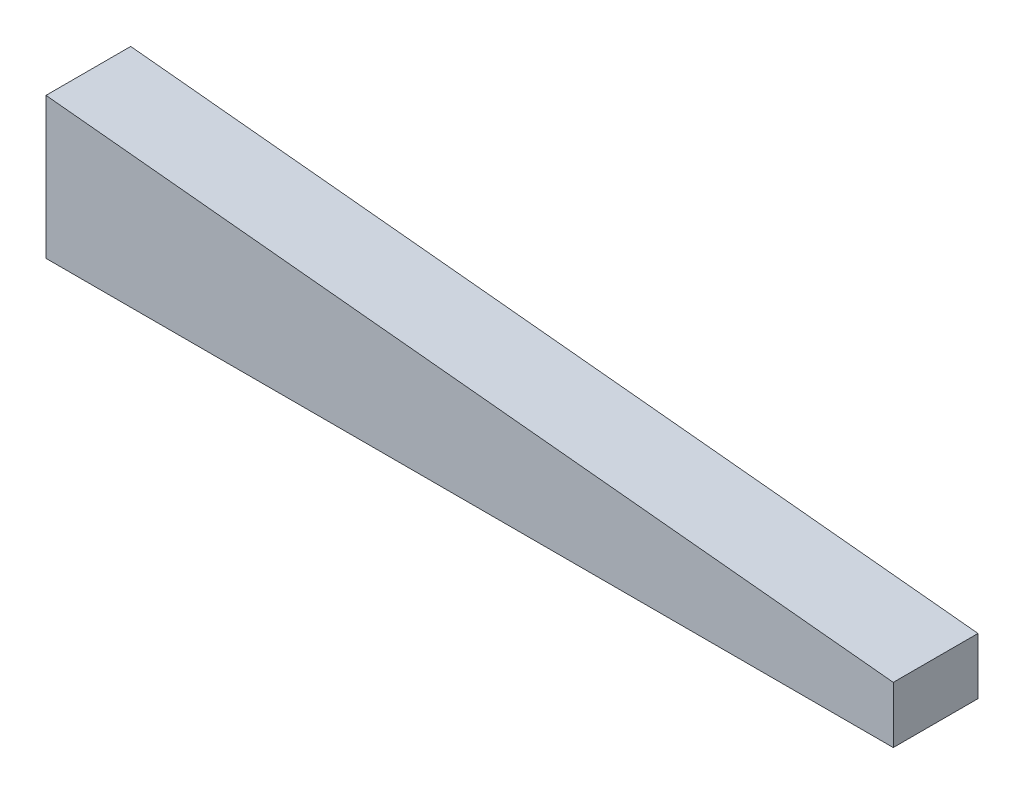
from build123d import *

# Parameters (mm, degrees)
BOSS_EXTRU_1_DEPTH = 3


with BuildPart() as part:
    # Esquisse1 → Boss.-Extru.1 (new body)
    with BuildSketch(Plane.XY):
        Polygon((-15, 2.5), (15, -0.5), (15, -2.5), (-15, -2.5), align=None)
    extrude(amount=BOSS_EXTRU_1_DEPTH)


solid = part.part
